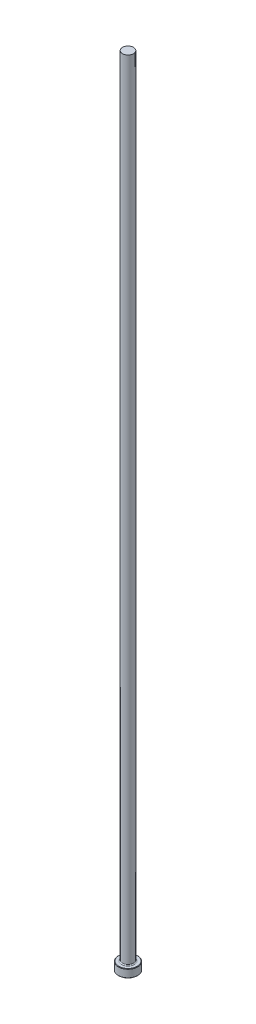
from build123d import *

# Parameters (mm, degrees)
CHAMFER1_SIZE = 0.254
FILLET1_R     = 0.508


with BuildPart() as part:
    # Sketch1 → Revolve1 (revolve)
    with BuildSketch(Plane.XY, mode=Mode.PRIVATE) as revolve1_sk:
        Polygon((0, 0), (-5.5499, 0), (-5.5499, 4.7498), (-3.175, 4.7498), (-3.175, 457.2), (0, 457.2), align=None)
    revolve(revolve1_sk.sketch.rotate(Axis((0, 259.958771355, 0), (0, -1, 0)), 270), axis=Axis((0, 259.958771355, 0), (0, -1, 0)))

    # Chamfer1
    chamfer1_edges = [part.edges().sort_by_distance(p)[0] for p in [
        (0, 4.7498, -5.5499),
        (0, 0, -5.5499),
    ]]
    chamfer(chamfer1_edges, length=CHAMFER1_SIZE)

    # Fillet1
    fillet1_edges = [part.edges().sort_by_distance(p)[0] for p in [
        (0, 4.7498, -3.175),
    ]]
    fillet(fillet1_edges, radius=FILLET1_R)


solid = part.part
